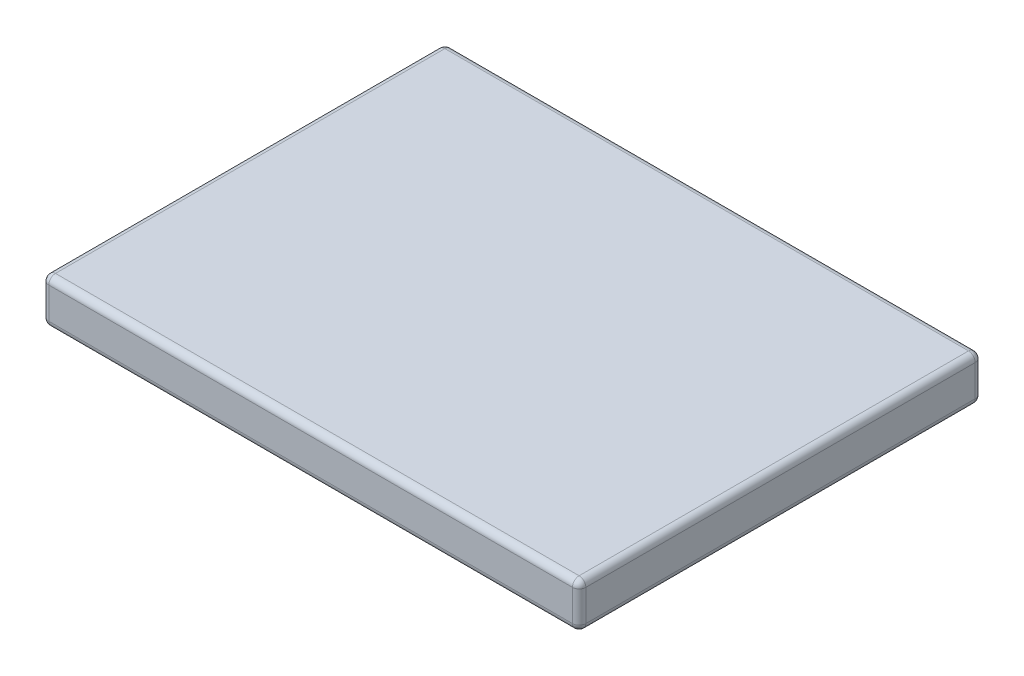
from build123d import *

# Parameters (mm, degrees)
SKETCH1_W      = 609.6
SKETCH1_H      = 457.2
EXTRUDE1_DEPTH = 50.8
FILLET1_R      = 7.62


with BuildPart() as part:
    # Sketch1 → Extrude1 (new body)
    with BuildSketch(Plane(origin=(0, 0, 0), x_dir=(1, 0, 0), z_dir=(0, 1, 0))):
        Rectangle(SKETCH1_W, SKETCH1_H)
    extrude(amount=EXTRUDE1_DEPTH)

    # Fillet1
    fillet1_edges = [part.edges().sort_by_distance(p)[0] for p in [
        (304.8, 50.8, 0),
        (0, 50.8, -228.6),
        (-304.8, 50.8, 0),
        (0, 0, -228.6),
        (304.8, 0, 0),
        (0, 0, 228.6),
        (-304.8, 0, 0),
        (0, 50.8, 228.6),
        (-304.8, 25.4, -228.6),
        (304.8, 25.4, -228.6),
        (304.8, 25.4, 228.6),
        (-304.8, 25.4, 228.6),
    ]]
    fillet(fillet1_edges, radius=FILLET1_R)


solid = part.part
